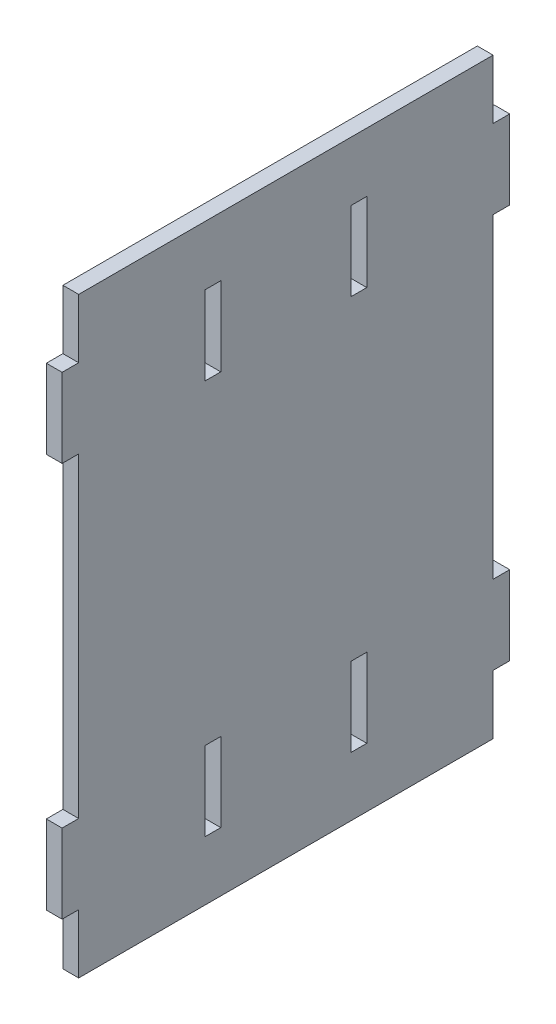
ISO-10303-21;
HEADER;
FILE_DESCRIPTION(('STEP AP214'),'2;1');
FILE_NAME('part.step','',(''),(''),'','','');
FILE_SCHEMA(('AUTOMOTIVE_DESIGN { 1 0 10303 214 1 1 1 1 }'));
ENDSEC;
DATA;
#1=APPLICATION_CONTEXT('core data for automotive mechanical design processes');
#2=APPLICATION_PROTOCOL_DEFINITION('international standard','automotive_design',2000,#1);
#3=PRODUCT_CONTEXT('',#1,'mechanical');
#4=PRODUCT('Part','Part','',(#3));
#5=PRODUCT_RELATED_PRODUCT_CATEGORY('part','',(#4));
#6=PRODUCT_DEFINITION_FORMATION('','',#4);
#7=PRODUCT_DEFINITION_CONTEXT('part definition',#1,'design');
#8=PRODUCT_DEFINITION('design','',#6,#7);
#9=PRODUCT_DEFINITION_SHAPE('','',#8);
#10=(LENGTH_UNIT() NAMED_UNIT(*) SI_UNIT(.MILLI.,.METRE.));
#11=(NAMED_UNIT(*) PLANE_ANGLE_UNIT() SI_UNIT($,.RADIAN.));
#12=(NAMED_UNIT(*) SI_UNIT($,.STERADIAN.) SOLID_ANGLE_UNIT());
#13=UNCERTAINTY_MEASURE_WITH_UNIT(LENGTH_MEASURE(1.E-05),#10,'distance_accuracy_value','');
#14=(GEOMETRIC_REPRESENTATION_CONTEXT(3) GLOBAL_UNCERTAINTY_ASSIGNED_CONTEXT((#13)) GLOBAL_UNIT_ASSIGNED_CONTEXT((#10,
#11,#12)) REPRESENTATION_CONTEXT('',''));
#15=CARTESIAN_POINT('',(0.,0.,0.));
#16=DIRECTION('',(0.,0.,1.));
#17=DIRECTION('',(1.,0.,0.));
#18=AXIS2_PLACEMENT_3D('',#15,#16,#17);
#19=CARTESIAN_POINT('',(4.,15.,52.5));
#20=DIRECTION('',(-1.,0.,0.));
#21=DIRECTION('',(0.,0.,1.));
#22=AXIS2_PLACEMENT_3D('',#19,#20,#21);
#23=PLANE('',#22);
#24=DIRECTION('',(0.,-1.,0.));
#25=VECTOR('',#24,1.);
#26=CARTESIAN_POINT('',(4.,35.,20.5));
#27=LINE('',#26,#25);
#28=CARTESIAN_POINT('',(4.,35.,20.5));
#29=VERTEX_POINT('',#28);
#30=CARTESIAN_POINT('',(4.,15.,20.5));
#31=VERTEX_POINT('',#30);
#32=EDGE_CURVE('E326',#29,#31,#27,.T.);
#33=ORIENTED_EDGE('',*,*,#32,.F.);
#34=DIRECTION('',(0.,0.,1.));
#35=VECTOR('',#34,1.);
#36=CARTESIAN_POINT('',(4.,35.,20.5));
#37=LINE('',#36,#35);
#38=CARTESIAN_POINT('',(4.,35.,16.5));
#39=VERTEX_POINT('',#38);
#40=EDGE_CURVE('E334',#39,#29,#37,.T.);
#41=ORIENTED_EDGE('',*,*,#40,.F.);
#42=DIRECTION('',(0.,1.,0.));
#43=VECTOR('',#42,1.);
#44=CARTESIAN_POINT('',(4.,35.,16.5));
#45=LINE('',#44,#43);
#46=CARTESIAN_POINT('',(4.,15.,16.5));
#47=VERTEX_POINT('',#46);
#48=EDGE_CURVE('E331',#47,#39,#45,.T.);
#49=ORIENTED_EDGE('',*,*,#48,.F.);
#50=DIRECTION('',(0.,0.,-1.));
#51=VECTOR('',#50,1.);
#52=CARTESIAN_POINT('',(4.,15.,20.5));
#53=LINE('',#52,#51);
#54=EDGE_CURVE('E328',#31,#47,#53,.T.);
#55=ORIENTED_EDGE('',*,*,#54,.F.);
#56=EDGE_LOOP('',(#33,#41,#49,#55));
#57=FACE_BOUND('',#56,.T.);
#58=DIRECTION('',(0.,-1.,0.));
#59=VECTOR('',#58,1.);
#60=CARTESIAN_POINT('',(4.,135.,20.5));
#61=LINE('',#60,#59);
#62=CARTESIAN_POINT('',(4.,135.,20.5));
#63=VERTEX_POINT('',#62);
#64=CARTESIAN_POINT('',(4.,115.,20.5));
#65=VERTEX_POINT('',#64);
#66=EDGE_CURVE('E388',#63,#65,#61,.T.);
#67=ORIENTED_EDGE('',*,*,#66,.F.);
#68=DIRECTION('',(0.,0.,1.));
#69=VECTOR('',#68,1.);
#70=CARTESIAN_POINT('',(4.,135.,20.5));
#71=LINE('',#70,#69);
#72=CARTESIAN_POINT('',(4.,135.,16.5));
#73=VERTEX_POINT('',#72);
#74=EDGE_CURVE('E399',#73,#63,#71,.T.);
#75=ORIENTED_EDGE('',*,*,#74,.F.);
#76=DIRECTION('',(0.,1.,0.));
#77=VECTOR('',#76,1.);
#78=CARTESIAN_POINT('',(4.,135.,16.5));
#79=LINE('',#78,#77);
#80=CARTESIAN_POINT('',(4.,115.,16.5));
#81=VERTEX_POINT('',#80);
#82=EDGE_CURVE('E395',#81,#73,#79,.T.);
#83=ORIENTED_EDGE('',*,*,#82,.F.);
#84=DIRECTION('',(0.,0.,-1.));
#85=VECTOR('',#84,1.);
#86=CARTESIAN_POINT('',(4.,115.,20.5));
#87=LINE('',#86,#85);
#88=EDGE_CURVE('E391',#65,#81,#87,.T.);
#89=ORIENTED_EDGE('',*,*,#88,.F.);
#90=EDGE_LOOP('',(#67,#75,#83,#89));
#91=FACE_BOUND('',#90,.T.);
#92=DIRECTION('',(0.,-1.,0.));
#93=VECTOR('',#92,1.);
#94=CARTESIAN_POINT('',(4.,0.,52.5));
#95=LINE('',#94,#93);
#96=CARTESIAN_POINT('',(4.,15.,52.5));
#97=VERTEX_POINT('',#96);
#98=CARTESIAN_POINT('',(4.,0.,52.5));
#99=VERTEX_POINT('',#98);
#100=EDGE_CURVE('E431',#97,#99,#95,.T.);
#101=ORIENTED_EDGE('',*,*,#100,.T.);
#102=DIRECTION('',(0.,0.,-1.));
#103=VECTOR('',#102,1.);
#104=CARTESIAN_POINT('',(4.,0.,52.5));
#105=LINE('',#104,#103);
#106=CARTESIAN_POINT('',(4.,0.,-52.5));
#107=VERTEX_POINT('',#106);
#108=EDGE_CURVE('E434',#99,#107,#105,.T.);
#109=ORIENTED_EDGE('',*,*,#108,.T.);
#110=DIRECTION('',(0.,1.,0.));
#111=VECTOR('',#110,1.);
#112=CARTESIAN_POINT('',(4.,0.,-52.5));
#113=LINE('',#112,#111);
#114=CARTESIAN_POINT('',(4.,15.,-52.5));
#115=VERTEX_POINT('',#114);
#116=EDGE_CURVE('E437',#107,#115,#113,.T.);
#117=ORIENTED_EDGE('',*,*,#116,.T.);
#118=DIRECTION('',(0.,0.,-1.));
#119=VECTOR('',#118,1.);
#120=CARTESIAN_POINT('',(4.,15.,-52.5));
#121=LINE('',#120,#119);
#122=CARTESIAN_POINT('',(4.,15.,-56.7));
#123=VERTEX_POINT('',#122);
#124=EDGE_CURVE('E439',#115,#123,#121,.T.);
#125=ORIENTED_EDGE('',*,*,#124,.T.);
#126=DIRECTION('',(0.,1.,0.));
#127=VECTOR('',#126,1.);
#128=CARTESIAN_POINT('',(4.,35.,-56.7));
#129=LINE('',#128,#127);
#130=CARTESIAN_POINT('',(4.,35.,-56.7));
#131=VERTEX_POINT('',#130);
#132=EDGE_CURVE('E441',#123,#131,#129,.T.);
#133=ORIENTED_EDGE('',*,*,#132,.T.);
#134=DIRECTION('',(0.,0.,1.));
#135=VECTOR('',#134,1.);
#136=CARTESIAN_POINT('',(4.,35.,-52.5));
#137=LINE('',#136,#135);
#138=CARTESIAN_POINT('',(4.,35.,-52.5));
#139=VERTEX_POINT('',#138);
#140=EDGE_CURVE('E443',#131,#139,#137,.T.);
#141=ORIENTED_EDGE('',*,*,#140,.T.);
#142=DIRECTION('',(0.,1.,0.));
#143=VECTOR('',#142,1.);
#144=CARTESIAN_POINT('',(4.,35.,-52.5));
#145=LINE('',#144,#143);
#146=CARTESIAN_POINT('',(4.,115.,-52.5));
#147=VERTEX_POINT('',#146);
#148=EDGE_CURVE('E445',#139,#147,#145,.T.);
#149=ORIENTED_EDGE('',*,*,#148,.T.);
#150=DIRECTION('',(0.,0.,-1.));
#151=VECTOR('',#150,1.);
#152=CARTESIAN_POINT('',(4.,115.,-52.5));
#153=LINE('',#152,#151);
#154=CARTESIAN_POINT('',(4.,115.,-56.7));
#155=VERTEX_POINT('',#154);
#156=EDGE_CURVE('E447',#147,#155,#153,.T.);
#157=ORIENTED_EDGE('',*,*,#156,.T.);
#158=DIRECTION('',(0.,1.,0.));
#159=VECTOR('',#158,1.);
#160=CARTESIAN_POINT('',(4.,135.,-56.7));
#161=LINE('',#160,#159);
#162=CARTESIAN_POINT('',(4.,135.,-56.7));
#163=VERTEX_POINT('',#162);
#164=EDGE_CURVE('E449',#155,#163,#161,.T.);
#165=ORIENTED_EDGE('',*,*,#164,.T.);
#166=DIRECTION('',(0.,0.,1.));
#167=VECTOR('',#166,1.);
#168=CARTESIAN_POINT('',(4.,135.,-52.5));
#169=LINE('',#168,#167);
#170=CARTESIAN_POINT('',(4.,135.,-52.5));
#171=VERTEX_POINT('',#170);
#172=EDGE_CURVE('E451',#163,#171,#169,.T.);
#173=ORIENTED_EDGE('',*,*,#172,.T.);
#174=DIRECTION('',(0.,1.,0.));
#175=VECTOR('',#174,1.);
#176=CARTESIAN_POINT('',(4.,135.,-52.5));
#177=LINE('',#176,#175);
#178=CARTESIAN_POINT('',(4.,150.,-52.5));
#179=VERTEX_POINT('',#178);
#180=EDGE_CURVE('E453',#171,#179,#177,.T.);
#181=ORIENTED_EDGE('',*,*,#180,.T.);
#182=DIRECTION('',(0.,0.,1.));
#183=VECTOR('',#182,1.);
#184=CARTESIAN_POINT('',(4.,150.,52.5));
#185=LINE('',#184,#183);
#186=CARTESIAN_POINT('',(4.,150.,52.5));
#187=VERTEX_POINT('',#186);
#188=EDGE_CURVE('E455',#179,#187,#185,.T.);
#189=ORIENTED_EDGE('',*,*,#188,.T.);
#190=DIRECTION('',(0.,-1.,0.));
#191=VECTOR('',#190,1.);
#192=CARTESIAN_POINT('',(4.,135.,52.5));
#193=LINE('',#192,#191);
#194=CARTESIAN_POINT('',(4.,135.,52.5));
#195=VERTEX_POINT('',#194);
#196=EDGE_CURVE('E458',#187,#195,#193,.T.);
#197=ORIENTED_EDGE('',*,*,#196,.T.);
#198=DIRECTION('',(0.,0.,1.));
#199=VECTOR('',#198,1.);
#200=CARTESIAN_POINT('',(4.,135.,56.7));
#201=LINE('',#200,#199);
#202=CARTESIAN_POINT('',(4.,135.,56.7));
#203=VERTEX_POINT('',#202);
#204=EDGE_CURVE('E461',#195,#203,#201,.T.);
#205=ORIENTED_EDGE('',*,*,#204,.T.);
#206=DIRECTION('',(0.,-1.,0.));
#207=VECTOR('',#206,1.);
#208=CARTESIAN_POINT('',(4.,135.,56.7));
#209=LINE('',#208,#207);
#210=CARTESIAN_POINT('',(4.,115.,56.7));
#211=VERTEX_POINT('',#210);
#212=EDGE_CURVE('E464',#203,#211,#209,.T.);
#213=ORIENTED_EDGE('',*,*,#212,.T.);
#214=DIRECTION('',(0.,0.,-1.));
#215=VECTOR('',#214,1.);
#216=CARTESIAN_POINT('',(4.,115.,56.7));
#217=LINE('',#216,#215);
#218=CARTESIAN_POINT('',(4.,115.,52.5));
#219=VERTEX_POINT('',#218);
#220=EDGE_CURVE('E467',#211,#219,#217,.T.);
#221=ORIENTED_EDGE('',*,*,#220,.T.);
#222=DIRECTION('',(0.,-1.,0.));
#223=VECTOR('',#222,1.);
#224=CARTESIAN_POINT('',(4.,35.,52.5));
#225=LINE('',#224,#223);
#226=CARTESIAN_POINT('',(4.,35.,52.5));
#227=VERTEX_POINT('',#226);
#228=EDGE_CURVE('E470',#219,#227,#225,.T.);
#229=ORIENTED_EDGE('',*,*,#228,.T.);
#230=DIRECTION('',(0.,0.,1.));
#231=VECTOR('',#230,1.);
#232=CARTESIAN_POINT('',(4.,35.,56.7));
#233=LINE('',#232,#231);
#234=CARTESIAN_POINT('',(4.,35.,56.7));
#235=VERTEX_POINT('',#234);
#236=EDGE_CURVE('E473',#227,#235,#233,.T.);
#237=ORIENTED_EDGE('',*,*,#236,.T.);
#238=DIRECTION('',(0.,-1.,0.));
#239=VECTOR('',#238,1.);
#240=CARTESIAN_POINT('',(4.,35.,56.7));
#241=LINE('',#240,#239);
#242=CARTESIAN_POINT('',(4.,15.,56.7));
#243=VERTEX_POINT('',#242);
#244=EDGE_CURVE('E475',#235,#243,#241,.T.);
#245=ORIENTED_EDGE('',*,*,#244,.T.);
#246=DIRECTION('',(0.,0.,-1.));
#247=VECTOR('',#246,1.);
#248=CARTESIAN_POINT('',(4.,15.,56.7));
#249=LINE('',#248,#247);
#250=EDGE_CURVE('E477',#243,#97,#249,.T.);
#251=ORIENTED_EDGE('',*,*,#250,.T.);
#252=EDGE_LOOP('',(#101,#109,#117,#125,#133,#141,#149,#157,#165,#173,#181,#189,#197,#205,#213,
#221,#229,#237,#245,#251));
#253=FACE_BOUND('',#252,.T.);
#254=DIRECTION('',(0.,1.,0.));
#255=VECTOR('',#254,1.);
#256=CARTESIAN_POINT('',(4.,135.,-20.5));
#257=LINE('',#256,#255);
#258=CARTESIAN_POINT('',(4.,115.,-20.5));
#259=VERTEX_POINT('',#258);
#260=CARTESIAN_POINT('',(4.,135.,-20.5));
#261=VERTEX_POINT('',#260);
#262=EDGE_CURVE('E357',#259,#261,#257,.T.);
#263=ORIENTED_EDGE('',*,*,#262,.F.);
#264=DIRECTION('',(0.,0.,-1.));
#265=VECTOR('',#264,1.);
#266=CARTESIAN_POINT('',(4.,115.,-20.5));
#267=LINE('',#266,#265);
#268=CARTESIAN_POINT('',(4.,115.,-16.5));
#269=VERTEX_POINT('',#268);
#270=EDGE_CURVE('E365',#269,#259,#267,.T.);
#271=ORIENTED_EDGE('',*,*,#270,.F.);
#272=DIRECTION('',(0.,-1.,0.));
#273=VECTOR('',#272,1.);
#274=CARTESIAN_POINT('',(4.,135.,-16.5));
#275=LINE('',#274,#273);
#276=CARTESIAN_POINT('',(4.,135.,-16.5));
#277=VERTEX_POINT('',#276);
#278=EDGE_CURVE('E362',#277,#269,#275,.T.);
#279=ORIENTED_EDGE('',*,*,#278,.F.);
#280=DIRECTION('',(0.,0.,1.));
#281=VECTOR('',#280,1.);
#282=CARTESIAN_POINT('',(4.,135.,-20.5));
#283=LINE('',#282,#281);
#284=EDGE_CURVE('E359',#261,#277,#283,.T.);
#285=ORIENTED_EDGE('',*,*,#284,.F.);
#286=EDGE_LOOP('',(#263,#271,#279,#285));
#287=FACE_BOUND('',#286,.T.);
#288=DIRECTION('',(0.,-1.,0.));
#289=VECTOR('',#288,1.);
#290=CARTESIAN_POINT('',(4.,35.,-16.5));
#291=LINE('',#290,#289);
#292=CARTESIAN_POINT('',(4.,35.,-16.5));
#293=VERTEX_POINT('',#292);
#294=CARTESIAN_POINT('',(4.,15.,-16.5));
#295=VERTEX_POINT('',#294);
#296=EDGE_CURVE('E290',#293,#295,#291,.T.);
#297=ORIENTED_EDGE('',*,*,#296,.F.);
#298=DIRECTION('',(0.,0.,1.));
#299=VECTOR('',#298,1.);
#300=CARTESIAN_POINT('',(4.,35.,-16.5));
#301=LINE('',#300,#299);
#302=CARTESIAN_POINT('',(4.,35.,-20.5));
#303=VERTEX_POINT('',#302);
#304=EDGE_CURVE('E312',#303,#293,#301,.T.);
#305=ORIENTED_EDGE('',*,*,#304,.F.);
#306=DIRECTION('',(0.,1.,0.));
#307=VECTOR('',#306,1.);
#308=CARTESIAN_POINT('',(4.,35.,-20.5));
#309=LINE('',#308,#307);
#310=CARTESIAN_POINT('',(4.,15.,-20.5));
#311=VERTEX_POINT('',#310);
#312=EDGE_CURVE('E310',#311,#303,#309,.T.);
#313=ORIENTED_EDGE('',*,*,#312,.F.);
#314=DIRECTION('',(0.,0.,-1.));
#315=VECTOR('',#314,1.);
#316=CARTESIAN_POINT('',(4.,15.,-16.5));
#317=LINE('',#316,#315);
#318=EDGE_CURVE('E298',#295,#311,#317,.T.);
#319=ORIENTED_EDGE('',*,*,#318,.F.);
#320=EDGE_LOOP('',(#297,#305,#313,#319));
#321=FACE_BOUND('',#320,.T.);
#322=ADVANCED_FACE('F39',(#57,#91,#253,#287,#321),#23,.F.);
#323=CARTESIAN_POINT('',(0.,15.,52.5));
#324=DIRECTION('',(-1.,0.,0.));
#325=DIRECTION('',(0.,0.,1.));
#326=AXIS2_PLACEMENT_3D('',#323,#324,#325);
#327=PLANE('',#326);
#328=DIRECTION('',(0.,0.,1.));
#329=VECTOR('',#328,1.);
#330=CARTESIAN_POINT('',(0.,35.,20.5));
#331=LINE('',#330,#329);
#332=CARTESIAN_POINT('',(0.,35.,16.5));
#333=VERTEX_POINT('',#332);
#334=CARTESIAN_POINT('',(0.,35.,20.5));
#335=VERTEX_POINT('',#334);
#336=EDGE_CURVE('E329',#333,#335,#331,.T.);
#337=ORIENTED_EDGE('',*,*,#336,.T.);
#338=DIRECTION('',(0.,-1.,0.));
#339=VECTOR('',#338,1.);
#340=CARTESIAN_POINT('',(0.,35.,20.5));
#341=LINE('',#340,#339);
#342=CARTESIAN_POINT('',(0.,15.,20.5));
#343=VERTEX_POINT('',#342);
#344=EDGE_CURVE('E306',#335,#343,#341,.T.);
#345=ORIENTED_EDGE('',*,*,#344,.T.);
#346=DIRECTION('',(0.,0.,-1.));
#347=VECTOR('',#346,1.);
#348=CARTESIAN_POINT('',(0.,15.,20.5));
#349=LINE('',#348,#347);
#350=CARTESIAN_POINT('',(0.,15.,16.5));
#351=VERTEX_POINT('',#350);
#352=EDGE_CURVE('E339',#343,#351,#349,.T.);
#353=ORIENTED_EDGE('',*,*,#352,.T.);
#354=DIRECTION('',(0.,1.,0.));
#355=VECTOR('',#354,1.);
#356=CARTESIAN_POINT('',(0.,35.,16.5));
#357=LINE('',#356,#355);
#358=EDGE_CURVE('E342',#351,#333,#357,.T.);
#359=ORIENTED_EDGE('',*,*,#358,.T.);
#360=EDGE_LOOP('',(#337,#345,#353,#359));
#361=FACE_BOUND('',#360,.T.);
#362=DIRECTION('',(0.,0.,1.));
#363=VECTOR('',#362,1.);
#364=CARTESIAN_POINT('',(0.,135.,20.5));
#365=LINE('',#364,#363);
#366=CARTESIAN_POINT('',(0.,135.,16.5));
#367=VERTEX_POINT('',#366);
#368=CARTESIAN_POINT('',(0.,135.,20.5));
#369=VERTEX_POINT('',#368);
#370=EDGE_CURVE('E392',#367,#369,#365,.T.);
#371=ORIENTED_EDGE('',*,*,#370,.T.);
#372=DIRECTION('',(0.,-1.,0.));
#373=VECTOR('',#372,1.);
#374=CARTESIAN_POINT('',(0.,135.,20.5));
#375=LINE('',#374,#373);
#376=CARTESIAN_POINT('',(0.,115.,20.5));
#377=VERTEX_POINT('',#376);
#378=EDGE_CURVE('E387',#369,#377,#375,.T.);
#379=ORIENTED_EDGE('',*,*,#378,.T.);
#380=DIRECTION('',(0.,0.,-1.));
#381=VECTOR('',#380,1.);
#382=CARTESIAN_POINT('',(0.,115.,20.5));
#383=LINE('',#382,#381);
#384=CARTESIAN_POINT('',(0.,115.,16.5));
#385=VERTEX_POINT('',#384);
#386=EDGE_CURVE('E406',#377,#385,#383,.T.);
#387=ORIENTED_EDGE('',*,*,#386,.T.);
#388=DIRECTION('',(0.,1.,0.));
#389=VECTOR('',#388,1.);
#390=CARTESIAN_POINT('',(0.,135.,16.5));
#391=LINE('',#390,#389);
#392=EDGE_CURVE('E410',#385,#367,#391,.T.);
#393=ORIENTED_EDGE('',*,*,#392,.T.);
#394=EDGE_LOOP('',(#371,#379,#387,#393));
#395=FACE_BOUND('',#394,.T.);
#396=DIRECTION('',(0.,-1.,0.));
#397=VECTOR('',#396,1.);
#398=CARTESIAN_POINT('',(0.,0.,52.5));
#399=LINE('',#398,#397);
#400=CARTESIAN_POINT('',(0.,15.,52.5));
#401=VERTEX_POINT('',#400);
#402=CARTESIAN_POINT('',(0.,0.,52.5));
#403=VERTEX_POINT('',#402);
#404=EDGE_CURVE('E430',#401,#403,#399,.T.);
#405=ORIENTED_EDGE('',*,*,#404,.F.);
#406=DIRECTION('',(0.,0.,-1.));
#407=VECTOR('',#406,1.);
#408=CARTESIAN_POINT('',(0.,15.,56.7));
#409=LINE('',#408,#407);
#410=CARTESIAN_POINT('',(0.,15.,56.7));
#411=VERTEX_POINT('',#410);
#412=EDGE_CURVE('E435',#411,#401,#409,.T.);
#413=ORIENTED_EDGE('',*,*,#412,.F.);
#414=DIRECTION('',(0.,-1.,0.));
#415=VECTOR('',#414,1.);
#416=CARTESIAN_POINT('',(0.,35.,56.7));
#417=LINE('',#416,#415);
#418=CARTESIAN_POINT('',(0.,35.,56.7));
#419=VERTEX_POINT('',#418);
#420=EDGE_CURVE('E522',#419,#411,#417,.T.);
#421=ORIENTED_EDGE('',*,*,#420,.F.);
#422=DIRECTION('',(0.,0.,1.));
#423=VECTOR('',#422,1.);
#424=CARTESIAN_POINT('',(0.,35.,56.7));
#425=LINE('',#424,#423);
#426=CARTESIAN_POINT('',(0.,35.,52.5));
#427=VERTEX_POINT('',#426);
#428=EDGE_CURVE('E520',#427,#419,#425,.T.);
#429=ORIENTED_EDGE('',*,*,#428,.F.);
#430=DIRECTION('',(0.,-1.,0.));
#431=VECTOR('',#430,1.);
#432=CARTESIAN_POINT('',(0.,35.,52.5));
#433=LINE('',#432,#431);
#434=CARTESIAN_POINT('',(0.,115.,52.5));
#435=VERTEX_POINT('',#434);
#436=EDGE_CURVE('E517',#435,#427,#433,.T.);
#437=ORIENTED_EDGE('',*,*,#436,.F.);
#438=DIRECTION('',(0.,0.,-1.));
#439=VECTOR('',#438,1.);
#440=CARTESIAN_POINT('',(0.,115.,56.7));
#441=LINE('',#440,#439);
#442=CARTESIAN_POINT('',(0.,115.,56.7));
#443=VERTEX_POINT('',#442);
#444=EDGE_CURVE('E514',#443,#435,#441,.T.);
#445=ORIENTED_EDGE('',*,*,#444,.F.);
#446=DIRECTION('',(0.,-1.,0.));
#447=VECTOR('',#446,1.);
#448=CARTESIAN_POINT('',(0.,135.,56.7));
#449=LINE('',#448,#447);
#450=CARTESIAN_POINT('',(0.,135.,56.7));
#451=VERTEX_POINT('',#450);
#452=EDGE_CURVE('E511',#451,#443,#449,.T.);
#453=ORIENTED_EDGE('',*,*,#452,.F.);
#454=DIRECTION('',(0.,0.,1.));
#455=VECTOR('',#454,1.);
#456=CARTESIAN_POINT('',(0.,135.,56.7));
#457=LINE('',#456,#455);
#458=CARTESIAN_POINT('',(0.,135.,52.5));
#459=VERTEX_POINT('',#458);
#460=EDGE_CURVE('E508',#459,#451,#457,.T.);
#461=ORIENTED_EDGE('',*,*,#460,.F.);
#462=DIRECTION('',(0.,-1.,0.));
#463=VECTOR('',#462,1.);
#464=CARTESIAN_POINT('',(0.,135.,52.5));
#465=LINE('',#464,#463);
#466=CARTESIAN_POINT('',(0.,150.,52.5));
#467=VERTEX_POINT('',#466);
#468=EDGE_CURVE('E505',#467,#459,#465,.T.);
#469=ORIENTED_EDGE('',*,*,#468,.F.);
#470=DIRECTION('',(0.,0.,1.));
#471=VECTOR('',#470,1.);
#472=CARTESIAN_POINT('',(0.,150.,52.5));
#473=LINE('',#472,#471);
#474=CARTESIAN_POINT('',(0.,150.,-52.5));
#475=VERTEX_POINT('',#474);
#476=EDGE_CURVE('E502',#475,#467,#473,.T.);
#477=ORIENTED_EDGE('',*,*,#476,.F.);
#478=DIRECTION('',(0.,1.,0.));
#479=VECTOR('',#478,1.);
#480=CARTESIAN_POINT('',(0.,135.,-52.5));
#481=LINE('',#480,#479);
#482=CARTESIAN_POINT('',(0.,135.,-52.5));
#483=VERTEX_POINT('',#482);
#484=EDGE_CURVE('E500',#483,#475,#481,.T.);
#485=ORIENTED_EDGE('',*,*,#484,.F.);
#486=DIRECTION('',(0.,0.,1.));
#487=VECTOR('',#486,1.);
#488=CARTESIAN_POINT('',(0.,135.,-52.5));
#489=LINE('',#488,#487);
#490=CARTESIAN_POINT('',(0.,135.,-56.7));
#491=VERTEX_POINT('',#490);
#492=EDGE_CURVE('E498',#491,#483,#489,.T.);
#493=ORIENTED_EDGE('',*,*,#492,.F.);
#494=DIRECTION('',(0.,1.,0.));
#495=VECTOR('',#494,1.);
#496=CARTESIAN_POINT('',(0.,135.,-56.7));
#497=LINE('',#496,#495);
#498=CARTESIAN_POINT('',(0.,115.,-56.7));
#499=VERTEX_POINT('',#498);
#500=EDGE_CURVE('E496',#499,#491,#497,.T.);
#501=ORIENTED_EDGE('',*,*,#500,.F.);
#502=DIRECTION('',(0.,0.,-1.));
#503=VECTOR('',#502,1.);
#504=CARTESIAN_POINT('',(0.,115.,-52.5));
#505=LINE('',#504,#503);
#506=CARTESIAN_POINT('',(0.,115.,-52.5));
#507=VERTEX_POINT('',#506);
#508=EDGE_CURVE('E494',#507,#499,#505,.T.);
#509=ORIENTED_EDGE('',*,*,#508,.F.);
#510=DIRECTION('',(0.,1.,0.));
#511=VECTOR('',#510,1.);
#512=CARTESIAN_POINT('',(0.,35.,-52.5));
#513=LINE('',#512,#511);
#514=CARTESIAN_POINT('',(0.,35.,-52.5));
#515=VERTEX_POINT('',#514);
#516=EDGE_CURVE('E492',#515,#507,#513,.T.);
#517=ORIENTED_EDGE('',*,*,#516,.F.);
#518=DIRECTION('',(0.,0.,1.));
#519=VECTOR('',#518,1.);
#520=CARTESIAN_POINT('',(0.,35.,-52.5));
#521=LINE('',#520,#519);
#522=CARTESIAN_POINT('',(0.,35.,-56.7));
#523=VERTEX_POINT('',#522);
#524=EDGE_CURVE('E490',#523,#515,#521,.T.);
#525=ORIENTED_EDGE('',*,*,#524,.F.);
#526=DIRECTION('',(0.,1.,0.));
#527=VECTOR('',#526,1.);
#528=CARTESIAN_POINT('',(0.,35.,-56.7));
#529=LINE('',#528,#527);
#530=CARTESIAN_POINT('',(0.,15.,-56.7));
#531=VERTEX_POINT('',#530);
#532=EDGE_CURVE('E488',#531,#523,#529,.T.);
#533=ORIENTED_EDGE('',*,*,#532,.F.);
#534=DIRECTION('',(0.,0.,-1.));
#535=VECTOR('',#534,1.);
#536=CARTESIAN_POINT('',(0.,15.,-52.5));
#537=LINE('',#536,#535);
#538=CARTESIAN_POINT('',(0.,15.,-52.5));
#539=VERTEX_POINT('',#538);
#540=EDGE_CURVE('E486',#539,#531,#537,.T.);
#541=ORIENTED_EDGE('',*,*,#540,.F.);
#542=DIRECTION('',(0.,1.,0.));
#543=VECTOR('',#542,1.);
#544=CARTESIAN_POINT('',(0.,0.,-52.5));
#545=LINE('',#544,#543);
#546=CARTESIAN_POINT('',(0.,0.,-52.5));
#547=VERTEX_POINT('',#546);
#548=EDGE_CURVE('E484',#547,#539,#545,.T.);
#549=ORIENTED_EDGE('',*,*,#548,.F.);
#550=DIRECTION('',(0.,0.,-1.));
#551=VECTOR('',#550,1.);
#552=CARTESIAN_POINT('',(0.,0.,52.5));
#553=LINE('',#552,#551);
#554=EDGE_CURVE('E482',#403,#547,#553,.T.);
#555=ORIENTED_EDGE('',*,*,#554,.F.);
#556=EDGE_LOOP('',(#405,#413,#421,#429,#437,#445,#453,#461,#469,#477,#485,#493,#501,#509,#517,
#525,#533,#541,#549,#555));
#557=FACE_BOUND('',#556,.T.);
#558=DIRECTION('',(0.,0.,-1.));
#559=VECTOR('',#558,1.);
#560=CARTESIAN_POINT('',(0.,115.,-20.5));
#561=LINE('',#560,#559);
#562=CARTESIAN_POINT('',(0.,115.,-16.5));
#563=VERTEX_POINT('',#562);
#564=CARTESIAN_POINT('',(0.,115.,-20.5));
#565=VERTEX_POINT('',#564);
#566=EDGE_CURVE('E360',#563,#565,#561,.T.);
#567=ORIENTED_EDGE('',*,*,#566,.T.);
#568=DIRECTION('',(0.,1.,0.));
#569=VECTOR('',#568,1.);
#570=CARTESIAN_POINT('',(0.,135.,-20.5));
#571=LINE('',#570,#569);
#572=CARTESIAN_POINT('',(0.,135.,-20.5));
#573=VERTEX_POINT('',#572);
#574=EDGE_CURVE('E356',#565,#573,#571,.T.);
#575=ORIENTED_EDGE('',*,*,#574,.T.);
#576=DIRECTION('',(0.,0.,1.));
#577=VECTOR('',#576,1.);
#578=CARTESIAN_POINT('',(0.,135.,-20.5));
#579=LINE('',#578,#577);
#580=CARTESIAN_POINT('',(0.,135.,-16.5));
#581=VERTEX_POINT('',#580);
#582=EDGE_CURVE('E370',#573,#581,#579,.T.);
#583=ORIENTED_EDGE('',*,*,#582,.T.);
#584=DIRECTION('',(0.,-1.,0.));
#585=VECTOR('',#584,1.);
#586=CARTESIAN_POINT('',(0.,135.,-16.5));
#587=LINE('',#586,#585);
#588=EDGE_CURVE('E373',#581,#563,#587,.T.);
#589=ORIENTED_EDGE('',*,*,#588,.T.);
#590=EDGE_LOOP('',(#567,#575,#583,#589));
#591=FACE_BOUND('',#590,.T.);
#592=DIRECTION('',(0.,0.,1.));
#593=VECTOR('',#592,1.);
#594=CARTESIAN_POINT('',(0.,35.,-16.5));
#595=LINE('',#594,#593);
#596=CARTESIAN_POINT('',(0.,35.,-20.5));
#597=VERTEX_POINT('',#596);
#598=CARTESIAN_POINT('',(0.,35.,-16.5));
#599=VERTEX_POINT('',#598);
#600=EDGE_CURVE('E299',#597,#599,#595,.T.);
#601=ORIENTED_EDGE('',*,*,#600,.T.);
#602=DIRECTION('',(0.,-1.,0.));
#603=VECTOR('',#602,1.);
#604=CARTESIAN_POINT('',(0.,35.,-16.5));
#605=LINE('',#604,#603);
#606=CARTESIAN_POINT('',(0.,15.,-16.5));
#607=VERTEX_POINT('',#606);
#608=EDGE_CURVE('E62',#599,#607,#605,.T.);
#609=ORIENTED_EDGE('',*,*,#608,.T.);
#610=DIRECTION('',(0.,0.,-1.));
#611=VECTOR('',#610,1.);
#612=CARTESIAN_POINT('',(0.,15.,-16.5));
#613=LINE('',#612,#611);
#614=CARTESIAN_POINT('',(0.,15.,-20.5));
#615=VERTEX_POINT('',#614);
#616=EDGE_CURVE('E305',#607,#615,#613,.T.);
#617=ORIENTED_EDGE('',*,*,#616,.T.);
#618=DIRECTION('',(0.,1.,0.));
#619=VECTOR('',#618,1.);
#620=CARTESIAN_POINT('',(0.,35.,-20.5));
#621=LINE('',#620,#619);
#622=EDGE_CURVE('E318',#615,#597,#621,.T.);
#623=ORIENTED_EDGE('',*,*,#622,.T.);
#624=EDGE_LOOP('',(#601,#609,#617,#623));
#625=FACE_BOUND('',#624,.T.);
#626=ADVANCED_FACE('F593',(#361,#395,#557,#591,#625),#327,.T.);
#627=CARTESIAN_POINT('',(4.,0.,52.5));
#628=DIRECTION('',(0.,0.,-1.));
#629=DIRECTION('',(-1.,0.,0.));
#630=AXIS2_PLACEMENT_3D('',#627,#628,#629);
#631=PLANE('',#630);
#632=ORIENTED_EDGE('',*,*,#404,.T.);
#633=DIRECTION('',(-1.,0.,0.));
#634=VECTOR('',#633,1.);
#635=CARTESIAN_POINT('',(4.,0.,52.5));
#636=LINE('',#635,#634);
#637=EDGE_CURVE('E11',#99,#403,#636,.T.);
#638=ORIENTED_EDGE('',*,*,#637,.F.);
#639=ORIENTED_EDGE('',*,*,#100,.F.);
#640=DIRECTION('',(-1.,0.,0.));
#641=VECTOR('',#640,1.);
#642=CARTESIAN_POINT('',(4.,15.,52.5));
#643=LINE('',#642,#641);
#644=EDGE_CURVE('E479',#97,#401,#643,.T.);
#645=ORIENTED_EDGE('',*,*,#644,.T.);
#646=EDGE_LOOP('',(#632,#638,#639,#645));
#647=FACE_BOUND('',#646,.T.);
#648=ADVANCED_FACE('F41',(#647),#631,.F.);
#649=CARTESIAN_POINT('',(4.,0.,52.5));
#650=DIRECTION('',(0.,1.,0.));
#651=DIRECTION('',(0.,0.,1.));
#652=AXIS2_PLACEMENT_3D('',#649,#650,#651);
#653=PLANE('',#652);
#654=ORIENTED_EDGE('',*,*,#554,.T.);
#655=DIRECTION('',(-1.,0.,0.));
#656=VECTOR('',#655,1.);
#657=CARTESIAN_POINT('',(4.,0.,-52.5));
#658=LINE('',#657,#656);
#659=EDGE_CURVE('E47',#107,#547,#658,.T.);
#660=ORIENTED_EDGE('',*,*,#659,.F.);
#661=ORIENTED_EDGE('',*,*,#108,.F.);
#662=ORIENTED_EDGE('',*,*,#637,.T.);
#663=EDGE_LOOP('',(#654,#660,#661,#662));
#664=FACE_BOUND('',#663,.T.);
#665=ADVANCED_FACE('F611',(#664),#653,.F.);
#666=CARTESIAN_POINT('',(4.,0.,-52.5));
#667=DIRECTION('',(0.,0.,1.));
#668=DIRECTION('',(1.,0.,0.));
#669=AXIS2_PLACEMENT_3D('',#666,#667,#668);
#670=PLANE('',#669);
#671=ORIENTED_EDGE('',*,*,#548,.T.);
#672=DIRECTION('',(-1.,0.,0.));
#673=VECTOR('',#672,1.);
#674=CARTESIAN_POINT('',(4.,15.,-52.5));
#675=LINE('',#674,#673);
#676=EDGE_CURVE('E580',#115,#539,#675,.T.);
#677=ORIENTED_EDGE('',*,*,#676,.F.);
#678=ORIENTED_EDGE('',*,*,#116,.F.);
#679=ORIENTED_EDGE('',*,*,#659,.T.);
#680=EDGE_LOOP('',(#671,#677,#678,#679));
#681=FACE_BOUND('',#680,.T.);
#682=ADVANCED_FACE('F587',(#681),#670,.F.);
#683=CARTESIAN_POINT('',(4.,15.,-52.5));
#684=DIRECTION('',(0.,1.,0.));
#685=DIRECTION('',(0.,0.,1.));
#686=AXIS2_PLACEMENT_3D('',#683,#684,#685);
#687=PLANE('',#686);
#688=ORIENTED_EDGE('',*,*,#540,.T.);
#689=DIRECTION('',(-1.,0.,0.));
#690=VECTOR('',#689,1.);
#691=CARTESIAN_POINT('',(4.,15.,-56.7));
#692=LINE('',#691,#690);
#693=EDGE_CURVE('E577',#123,#531,#692,.T.);
#694=ORIENTED_EDGE('',*,*,#693,.F.);
#695=ORIENTED_EDGE('',*,*,#124,.F.);
#696=ORIENTED_EDGE('',*,*,#676,.T.);
#697=EDGE_LOOP('',(#688,#694,#695,#696));
#698=FACE_BOUND('',#697,.T.);
#699=ADVANCED_FACE('F599',(#698),#687,.F.);
#700=CARTESIAN_POINT('',(4.,35.,-56.7));
#701=DIRECTION('',(0.,0.,1.));
#702=DIRECTION('',(1.,0.,0.));
#703=AXIS2_PLACEMENT_3D('',#700,#701,#702);
#704=PLANE('',#703);
#705=ORIENTED_EDGE('',*,*,#532,.T.);
#706=DIRECTION('',(-1.,0.,0.));
#707=VECTOR('',#706,1.);
#708=CARTESIAN_POINT('',(4.,35.,-56.7));
#709=LINE('',#708,#707);
#710=EDGE_CURVE('E574',#131,#523,#709,.T.);
#711=ORIENTED_EDGE('',*,*,#710,.F.);
#712=ORIENTED_EDGE('',*,*,#132,.F.);
#713=ORIENTED_EDGE('',*,*,#693,.T.);
#714=EDGE_LOOP('',(#705,#711,#712,#713));
#715=FACE_BOUND('',#714,.T.);
#716=ADVANCED_FACE('F603',(#715),#704,.F.);
#717=CARTESIAN_POINT('',(4.,35.,-52.5));
#718=DIRECTION('',(0.,-1.,0.));
#719=DIRECTION('',(0.,0.,-1.));
#720=AXIS2_PLACEMENT_3D('',#717,#718,#719);
#721=PLANE('',#720);
#722=ORIENTED_EDGE('',*,*,#524,.T.);
#723=DIRECTION('',(-1.,0.,0.));
#724=VECTOR('',#723,1.);
#725=CARTESIAN_POINT('',(4.,35.,-52.5));
#726=LINE('',#725,#724);
#727=EDGE_CURVE('E571',#139,#515,#726,.T.);
#728=ORIENTED_EDGE('',*,*,#727,.F.);
#729=ORIENTED_EDGE('',*,*,#140,.F.);
#730=ORIENTED_EDGE('',*,*,#710,.T.);
#731=EDGE_LOOP('',(#722,#728,#729,#730));
#732=FACE_BOUND('',#731,.T.);
#733=ADVANCED_FACE('F684',(#732),#721,.F.);
#734=CARTESIAN_POINT('',(4.,35.,-52.5));
#735=DIRECTION('',(0.,0.,1.));
#736=DIRECTION('',(0.,-1.,0.));
#737=AXIS2_PLACEMENT_3D('',#734,#735,#736);
#738=PLANE('',#737);
#739=ORIENTED_EDGE('',*,*,#516,.T.);
#740=DIRECTION('',(-1.,0.,0.));
#741=VECTOR('',#740,1.);
#742=CARTESIAN_POINT('',(4.,115.,-52.5));
#743=LINE('',#742,#741);
#744=EDGE_CURVE('E568',#147,#507,#743,.T.);
#745=ORIENTED_EDGE('',*,*,#744,.F.);
#746=ORIENTED_EDGE('',*,*,#148,.F.);
#747=ORIENTED_EDGE('',*,*,#727,.T.);
#748=EDGE_LOOP('',(#739,#745,#746,#747));
#749=FACE_BOUND('',#748,.T.);
#750=ADVANCED_FACE('F682',(#749),#738,.F.);
#751=CARTESIAN_POINT('',(4.,115.,-52.5));
#752=DIRECTION('',(0.,1.,0.));
#753=DIRECTION('',(0.,0.,1.));
#754=AXIS2_PLACEMENT_3D('',#751,#752,#753);
#755=PLANE('',#754);
#756=ORIENTED_EDGE('',*,*,#508,.T.);
#757=DIRECTION('',(-1.,0.,0.));
#758=VECTOR('',#757,1.);
#759=CARTESIAN_POINT('',(4.,115.,-56.7));
#760=LINE('',#759,#758);
#761=EDGE_CURVE('E565',#155,#499,#760,.T.);
#762=ORIENTED_EDGE('',*,*,#761,.F.);
#763=ORIENTED_EDGE('',*,*,#156,.F.);
#764=ORIENTED_EDGE('',*,*,#744,.T.);
#765=EDGE_LOOP('',(#756,#762,#763,#764));
#766=FACE_BOUND('',#765,.T.);
#767=ADVANCED_FACE('F677',(#766),#755,.F.);
#768=CARTESIAN_POINT('',(4.,135.,-56.7));
#769=DIRECTION('',(0.,0.,1.));
#770=DIRECTION('',(0.,-1.,0.));
#771=AXIS2_PLACEMENT_3D('',#768,#769,#770);
#772=PLANE('',#771);
#773=ORIENTED_EDGE('',*,*,#500,.T.);
#774=DIRECTION('',(-1.,0.,0.));
#775=VECTOR('',#774,1.);
#776=CARTESIAN_POINT('',(4.,135.,-56.7));
#777=LINE('',#776,#775);
#778=EDGE_CURVE('E562',#163,#491,#777,.T.);
#779=ORIENTED_EDGE('',*,*,#778,.F.);
#780=ORIENTED_EDGE('',*,*,#164,.F.);
#781=ORIENTED_EDGE('',*,*,#761,.T.);
#782=EDGE_LOOP('',(#773,#779,#780,#781));
#783=FACE_BOUND('',#782,.T.);
#784=ADVANCED_FACE('F672',(#783),#772,.F.);
#785=CARTESIAN_POINT('',(4.,135.,-52.5));
#786=DIRECTION('',(0.,-1.,0.));
#787=DIRECTION('',(0.,0.,-1.));
#788=AXIS2_PLACEMENT_3D('',#785,#786,#787);
#789=PLANE('',#788);
#790=ORIENTED_EDGE('',*,*,#492,.T.);
#791=DIRECTION('',(-1.,0.,0.));
#792=VECTOR('',#791,1.);
#793=CARTESIAN_POINT('',(4.,135.,-52.5));
#794=LINE('',#793,#792);
#795=EDGE_CURVE('E559',#171,#483,#794,.T.);
#796=ORIENTED_EDGE('',*,*,#795,.F.);
#797=ORIENTED_EDGE('',*,*,#172,.F.);
#798=ORIENTED_EDGE('',*,*,#778,.T.);
#799=EDGE_LOOP('',(#790,#796,#797,#798));
#800=FACE_BOUND('',#799,.T.);
#801=ADVANCED_FACE('F668',(#800),#789,.F.);
#802=CARTESIAN_POINT('',(4.,135.,-52.5));
#803=DIRECTION('',(0.,0.,1.));
#804=DIRECTION('',(1.,0.,0.));
#805=AXIS2_PLACEMENT_3D('',#802,#803,#804);
#806=PLANE('',#805);
#807=ORIENTED_EDGE('',*,*,#484,.T.);
#808=DIRECTION('',(-1.,0.,0.));
#809=VECTOR('',#808,1.);
#810=CARTESIAN_POINT('',(4.,150.,-52.5));
#811=LINE('',#810,#809);
#812=EDGE_CURVE('E556',#179,#475,#811,.T.);
#813=ORIENTED_EDGE('',*,*,#812,.F.);
#814=ORIENTED_EDGE('',*,*,#180,.F.);
#815=ORIENTED_EDGE('',*,*,#795,.T.);
#816=EDGE_LOOP('',(#807,#813,#814,#815));
#817=FACE_BOUND('',#816,.T.);
#818=ADVANCED_FACE('F663',(#817),#806,.F.);
#819=CARTESIAN_POINT('',(4.,150.,52.5));
#820=DIRECTION('',(0.,-1.,0.));
#821=DIRECTION('',(0.,0.,-1.));
#822=AXIS2_PLACEMENT_3D('',#819,#820,#821);
#823=PLANE('',#822);
#824=ORIENTED_EDGE('',*,*,#476,.T.);
#825=DIRECTION('',(-1.,0.,0.));
#826=VECTOR('',#825,1.);
#827=CARTESIAN_POINT('',(4.,150.,52.5));
#828=LINE('',#827,#826);
#829=EDGE_CURVE('E552',#187,#467,#828,.T.);
#830=ORIENTED_EDGE('',*,*,#829,.F.);
#831=ORIENTED_EDGE('',*,*,#188,.F.);
#832=ORIENTED_EDGE('',*,*,#812,.T.);
#833=EDGE_LOOP('',(#824,#830,#831,#832));
#834=FACE_BOUND('',#833,.T.);
#835=ADVANCED_FACE('F657',(#834),#823,.F.);
#836=CARTESIAN_POINT('',(4.,135.,52.5));
#837=DIRECTION('',(0.,0.,-1.));
#838=DIRECTION('',(-1.,0.,0.));
#839=AXIS2_PLACEMENT_3D('',#836,#837,#838);
#840=PLANE('',#839);
#841=ORIENTED_EDGE('',*,*,#468,.T.);
#842=DIRECTION('',(-1.,0.,0.));
#843=VECTOR('',#842,1.);
#844=CARTESIAN_POINT('',(4.,135.,52.5));
#845=LINE('',#844,#843);
#846=EDGE_CURVE('E548',#195,#459,#845,.T.);
#847=ORIENTED_EDGE('',*,*,#846,.F.);
#848=ORIENTED_EDGE('',*,*,#196,.F.);
#849=ORIENTED_EDGE('',*,*,#829,.T.);
#850=EDGE_LOOP('',(#841,#847,#848,#849));
#851=FACE_BOUND('',#850,.T.);
#852=ADVANCED_FACE('F653',(#851),#840,.F.);
#853=CARTESIAN_POINT('',(4.,135.,56.7));
#854=DIRECTION('',(0.,-1.,0.));
#855=DIRECTION('',(0.,0.,-1.));
#856=AXIS2_PLACEMENT_3D('',#853,#854,#855);
#857=PLANE('',#856);
#858=ORIENTED_EDGE('',*,*,#460,.T.);
#859=DIRECTION('',(-1.,0.,0.));
#860=VECTOR('',#859,1.);
#861=CARTESIAN_POINT('',(4.,135.,56.7));
#862=LINE('',#861,#860);
#863=EDGE_CURVE('E544',#203,#451,#862,.T.);
#864=ORIENTED_EDGE('',*,*,#863,.F.);
#865=ORIENTED_EDGE('',*,*,#204,.F.);
#866=ORIENTED_EDGE('',*,*,#846,.T.);
#867=EDGE_LOOP('',(#858,#864,#865,#866));
#868=FACE_BOUND('',#867,.T.);
#869=ADVANCED_FACE('F648',(#868),#857,.F.);
#870=CARTESIAN_POINT('',(4.,135.,56.7));
#871=DIRECTION('',(0.,0.,-1.));
#872=DIRECTION('',(0.,1.,0.));
#873=AXIS2_PLACEMENT_3D('',#870,#871,#872);
#874=PLANE('',#873);
#875=ORIENTED_EDGE('',*,*,#452,.T.);
#876=DIRECTION('',(-1.,0.,0.));
#877=VECTOR('',#876,1.);
#878=CARTESIAN_POINT('',(4.,115.,56.7));
#879=LINE('',#878,#877);
#880=EDGE_CURVE('E540',#211,#443,#879,.T.);
#881=ORIENTED_EDGE('',*,*,#880,.F.);
#882=ORIENTED_EDGE('',*,*,#212,.F.);
#883=ORIENTED_EDGE('',*,*,#863,.T.);
#884=EDGE_LOOP('',(#875,#881,#882,#883));
#885=FACE_BOUND('',#884,.T.);
#886=ADVANCED_FACE('F642',(#885),#874,.F.);
#887=CARTESIAN_POINT('',(4.,115.,56.7));
#888=DIRECTION('',(0.,1.,0.));
#889=DIRECTION('',(0.,0.,1.));
#890=AXIS2_PLACEMENT_3D('',#887,#888,#889);
#891=PLANE('',#890);
#892=ORIENTED_EDGE('',*,*,#444,.T.);
#893=DIRECTION('',(-1.,0.,0.));
#894=VECTOR('',#893,1.);
#895=CARTESIAN_POINT('',(4.,115.,52.5));
#896=LINE('',#895,#894);
#897=EDGE_CURVE('E536',#219,#435,#896,.T.);
#898=ORIENTED_EDGE('',*,*,#897,.F.);
#899=ORIENTED_EDGE('',*,*,#220,.F.);
#900=ORIENTED_EDGE('',*,*,#880,.T.);
#901=EDGE_LOOP('',(#892,#898,#899,#900));
#902=FACE_BOUND('',#901,.T.);
#903=ADVANCED_FACE('F638',(#902),#891,.F.);
#904=CARTESIAN_POINT('',(4.,35.,52.5));
#905=DIRECTION('',(0.,0.,-1.));
#906=DIRECTION('',(0.,1.,0.));
#907=AXIS2_PLACEMENT_3D('',#904,#905,#906);
#908=PLANE('',#907);
#909=ORIENTED_EDGE('',*,*,#436,.T.);
#910=DIRECTION('',(-1.,0.,0.));
#911=VECTOR('',#910,1.);
#912=CARTESIAN_POINT('',(4.,35.,52.5));
#913=LINE('',#912,#911);
#914=EDGE_CURVE('E533',#227,#427,#913,.T.);
#915=ORIENTED_EDGE('',*,*,#914,.F.);
#916=ORIENTED_EDGE('',*,*,#228,.F.);
#917=ORIENTED_EDGE('',*,*,#897,.T.);
#918=EDGE_LOOP('',(#909,#915,#916,#917));
#919=FACE_BOUND('',#918,.T.);
#920=ADVANCED_FACE('F633',(#919),#908,.F.);
#921=CARTESIAN_POINT('',(4.,35.,56.7));
#922=DIRECTION('',(0.,-1.,0.));
#923=DIRECTION('',(0.,0.,-1.));
#924=AXIS2_PLACEMENT_3D('',#921,#922,#923);
#925=PLANE('',#924);
#926=ORIENTED_EDGE('',*,*,#428,.T.);
#927=DIRECTION('',(-1.,0.,0.));
#928=VECTOR('',#927,1.);
#929=CARTESIAN_POINT('',(4.,35.,56.7));
#930=LINE('',#929,#928);
#931=EDGE_CURVE('E530',#235,#419,#930,.T.);
#932=ORIENTED_EDGE('',*,*,#931,.F.);
#933=ORIENTED_EDGE('',*,*,#236,.F.);
#934=ORIENTED_EDGE('',*,*,#914,.T.);
#935=EDGE_LOOP('',(#926,#932,#933,#934));
#936=FACE_BOUND('',#935,.T.);
#937=ADVANCED_FACE('F627',(#936),#925,.F.);
#938=CARTESIAN_POINT('',(4.,35.,56.7));
#939=DIRECTION('',(0.,0.,-1.));
#940=DIRECTION('',(-1.,0.,0.));
#941=AXIS2_PLACEMENT_3D('',#938,#939,#940);
#942=PLANE('',#941);
#943=ORIENTED_EDGE('',*,*,#420,.T.);
#944=DIRECTION('',(-1.,0.,0.));
#945=VECTOR('',#944,1.);
#946=CARTESIAN_POINT('',(4.,15.,56.7));
#947=LINE('',#946,#945);
#948=EDGE_CURVE('E527',#243,#411,#947,.T.);
#949=ORIENTED_EDGE('',*,*,#948,.F.);
#950=ORIENTED_EDGE('',*,*,#244,.F.);
#951=ORIENTED_EDGE('',*,*,#931,.T.);
#952=EDGE_LOOP('',(#943,#949,#950,#951));
#953=FACE_BOUND('',#952,.T.);
#954=ADVANCED_FACE('F623',(#953),#942,.F.);
#955=CARTESIAN_POINT('',(4.,15.,56.7));
#956=DIRECTION('',(0.,1.,0.));
#957=DIRECTION('',(0.,0.,1.));
#958=AXIS2_PLACEMENT_3D('',#955,#956,#957);
#959=PLANE('',#958);
#960=ORIENTED_EDGE('',*,*,#412,.T.);
#961=ORIENTED_EDGE('',*,*,#644,.F.);
#962=ORIENTED_EDGE('',*,*,#250,.F.);
#963=ORIENTED_EDGE('',*,*,#948,.T.);
#964=EDGE_LOOP('',(#960,#961,#962,#963));
#965=FACE_BOUND('',#964,.T.);
#966=ADVANCED_FACE('F618',(#965),#959,.F.);
#967=CARTESIAN_POINT('',(4.,135.,20.5));
#968=DIRECTION('',(0.,0.,-1.));
#969=DIRECTION('',(0.,1.,0.));
#970=AXIS2_PLACEMENT_3D('',#967,#968,#969);
#971=PLANE('',#970);
#972=ORIENTED_EDGE('',*,*,#378,.F.);
#973=DIRECTION('',(-1.,0.,0.));
#974=VECTOR('',#973,1.);
#975=CARTESIAN_POINT('',(4.,135.,20.5));
#976=LINE('',#975,#974);
#977=EDGE_CURVE('E402',#63,#369,#976,.T.);
#978=ORIENTED_EDGE('',*,*,#977,.F.);
#979=ORIENTED_EDGE('',*,*,#66,.T.);
#980=DIRECTION('',(-1.,0.,0.));
#981=VECTOR('',#980,1.);
#982=CARTESIAN_POINT('',(4.,115.,20.5));
#983=LINE('',#982,#981);
#984=EDGE_CURVE('E426',#65,#377,#983,.T.);
#985=ORIENTED_EDGE('',*,*,#984,.T.);
#986=EDGE_LOOP('',(#972,#978,#979,#985));
#987=FACE_BOUND('',#986,.T.);
#988=ADVANCED_FACE('F704',(#987),#971,.T.);
#989=CARTESIAN_POINT('',(4.,115.,20.5));
#990=DIRECTION('',(0.,1.,0.));
#991=DIRECTION('',(0.,0.,1.));
#992=AXIS2_PLACEMENT_3D('',#989,#990,#991);
#993=PLANE('',#992);
#994=ORIENTED_EDGE('',*,*,#386,.F.);
#995=ORIENTED_EDGE('',*,*,#984,.F.);
#996=ORIENTED_EDGE('',*,*,#88,.T.);
#997=DIRECTION('',(-1.,0.,0.));
#998=VECTOR('',#997,1.);
#999=CARTESIAN_POINT('',(4.,115.,16.5));
#1000=LINE('',#999,#998);
#1001=EDGE_CURVE('E423',#81,#385,#1000,.T.);
#1002=ORIENTED_EDGE('',*,*,#1001,.T.);
#1003=EDGE_LOOP('',(#994,#995,#996,#1002));
#1004=FACE_BOUND('',#1003,.T.);
#1005=ADVANCED_FACE('F790',(#1004),#993,.T.);
#1006=CARTESIAN_POINT('',(4.,135.,16.5));
#1007=DIRECTION('',(0.,0.,1.));
#1008=DIRECTION('',(0.,-1.,0.));
#1009=AXIS2_PLACEMENT_3D('',#1006,#1007,#1008);
#1010=PLANE('',#1009);
#1011=ORIENTED_EDGE('',*,*,#392,.F.);
#1012=ORIENTED_EDGE('',*,*,#1001,.F.);
#1013=ORIENTED_EDGE('',*,*,#82,.T.);
#1014=DIRECTION('',(-1.,0.,0.));
#1015=VECTOR('',#1014,1.);
#1016=CARTESIAN_POINT('',(4.,135.,16.5));
#1017=LINE('',#1016,#1015);
#1018=EDGE_CURVE('E420',#73,#367,#1017,.T.);
#1019=ORIENTED_EDGE('',*,*,#1018,.T.);
#1020=EDGE_LOOP('',(#1011,#1012,#1013,#1019));
#1021=FACE_BOUND('',#1020,.T.);
#1022=ADVANCED_FACE('F797',(#1021),#1010,.T.);
#1023=CARTESIAN_POINT('',(4.,135.,20.5));
#1024=DIRECTION('',(0.,-1.,0.));
#1025=DIRECTION('',(0.,0.,-1.));
#1026=AXIS2_PLACEMENT_3D('',#1023,#1024,#1025);
#1027=PLANE('',#1026);
#1028=ORIENTED_EDGE('',*,*,#370,.F.);
#1029=ORIENTED_EDGE('',*,*,#1018,.F.);
#1030=ORIENTED_EDGE('',*,*,#74,.T.);
#1031=ORIENTED_EDGE('',*,*,#977,.T.);
#1032=EDGE_LOOP('',(#1028,#1029,#1030,#1031));
#1033=FACE_BOUND('',#1032,.T.);
#1034=ADVANCED_FACE('F804',(#1033),#1027,.T.);
#1035=CARTESIAN_POINT('',(4.,135.,-20.5));
#1036=DIRECTION('',(0.,0.,1.));
#1037=DIRECTION('',(0.,-1.,0.));
#1038=AXIS2_PLACEMENT_3D('',#1035,#1036,#1037);
#1039=PLANE('',#1038);
#1040=ORIENTED_EDGE('',*,*,#574,.F.);
#1041=DIRECTION('',(-1.,0.,0.));
#1042=VECTOR('',#1041,1.);
#1043=CARTESIAN_POINT('',(4.,115.,-20.5));
#1044=LINE('',#1043,#1042);
#1045=EDGE_CURVE('E367',#259,#565,#1044,.T.);
#1046=ORIENTED_EDGE('',*,*,#1045,.F.);
#1047=ORIENTED_EDGE('',*,*,#262,.T.);
#1048=DIRECTION('',(-1.,0.,0.));
#1049=VECTOR('',#1048,1.);
#1050=CARTESIAN_POINT('',(4.,135.,-20.5));
#1051=LINE('',#1050,#1049);
#1052=EDGE_CURVE('E384',#261,#573,#1051,.T.);
#1053=ORIENTED_EDGE('',*,*,#1052,.T.);
#1054=EDGE_LOOP('',(#1040,#1046,#1047,#1053));
#1055=FACE_BOUND('',#1054,.T.);
#1056=ADVANCED_FACE('F812',(#1055),#1039,.T.);
#1057=CARTESIAN_POINT('',(4.,135.,-20.5));
#1058=DIRECTION('',(0.,-1.,0.));
#1059=DIRECTION('',(0.,0.,-1.));
#1060=AXIS2_PLACEMENT_3D('',#1057,#1058,#1059);
#1061=PLANE('',#1060);
#1062=ORIENTED_EDGE('',*,*,#582,.F.);
#1063=ORIENTED_EDGE('',*,*,#1052,.F.);
#1064=ORIENTED_EDGE('',*,*,#284,.T.);
#1065=DIRECTION('',(-1.,0.,0.));
#1066=VECTOR('',#1065,1.);
#1067=CARTESIAN_POINT('',(4.,135.,-16.5));
#1068=LINE('',#1067,#1066);
#1069=EDGE_CURVE('E382',#277,#581,#1068,.T.);
#1070=ORIENTED_EDGE('',*,*,#1069,.T.);
#1071=EDGE_LOOP('',(#1062,#1063,#1064,#1070));
#1072=FACE_BOUND('',#1071,.T.);
#1073=ADVANCED_FACE('F820',(#1072),#1061,.T.);
#1074=CARTESIAN_POINT('',(4.,135.,-16.5));
#1075=DIRECTION('',(0.,0.,-1.));
#1076=DIRECTION('',(0.,1.,0.));
#1077=AXIS2_PLACEMENT_3D('',#1074,#1075,#1076);
#1078=PLANE('',#1077);
#1079=ORIENTED_EDGE('',*,*,#588,.F.);
#1080=ORIENTED_EDGE('',*,*,#1069,.F.);
#1081=ORIENTED_EDGE('',*,*,#278,.T.);
#1082=DIRECTION('',(-1.,0.,0.));
#1083=VECTOR('',#1082,1.);
#1084=CARTESIAN_POINT('',(4.,115.,-16.5));
#1085=LINE('',#1084,#1083);
#1086=EDGE_CURVE('E380',#269,#563,#1085,.T.);
#1087=ORIENTED_EDGE('',*,*,#1086,.T.);
#1088=EDGE_LOOP('',(#1079,#1080,#1081,#1087));
#1089=FACE_BOUND('',#1088,.T.);
#1090=ADVANCED_FACE('F828',(#1089),#1078,.T.);
#1091=CARTESIAN_POINT('',(4.,115.,-20.5));
#1092=DIRECTION('',(0.,1.,0.));
#1093=DIRECTION('',(0.,0.,1.));
#1094=AXIS2_PLACEMENT_3D('',#1091,#1092,#1093);
#1095=PLANE('',#1094);
#1096=ORIENTED_EDGE('',*,*,#566,.F.);
#1097=ORIENTED_EDGE('',*,*,#1086,.F.);
#1098=ORIENTED_EDGE('',*,*,#270,.T.);
#1099=ORIENTED_EDGE('',*,*,#1045,.T.);
#1100=EDGE_LOOP('',(#1096,#1097,#1098,#1099));
#1101=FACE_BOUND('',#1100,.T.);
#1102=ADVANCED_FACE('F836',(#1101),#1095,.T.);
#1103=CARTESIAN_POINT('',(4.,35.,20.5));
#1104=DIRECTION('',(0.,0.,-1.));
#1105=DIRECTION('',(0.,1.,0.));
#1106=AXIS2_PLACEMENT_3D('',#1103,#1104,#1105);
#1107=PLANE('',#1106);
#1108=ORIENTED_EDGE('',*,*,#344,.F.);
#1109=DIRECTION('',(-1.,0.,0.));
#1110=VECTOR('',#1109,1.);
#1111=CARTESIAN_POINT('',(4.,35.,20.5));
#1112=LINE('',#1111,#1110);
#1113=EDGE_CURVE('E336',#29,#335,#1112,.T.);
#1114=ORIENTED_EDGE('',*,*,#1113,.F.);
#1115=ORIENTED_EDGE('',*,*,#32,.T.);
#1116=DIRECTION('',(-1.,0.,0.));
#1117=VECTOR('',#1116,1.);
#1118=CARTESIAN_POINT('',(4.,15.,20.5));
#1119=LINE('',#1118,#1117);
#1120=EDGE_CURVE('E353',#31,#343,#1119,.T.);
#1121=ORIENTED_EDGE('',*,*,#1120,.T.);
#1122=EDGE_LOOP('',(#1108,#1114,#1115,#1121));
#1123=FACE_BOUND('',#1122,.T.);
#1124=ADVANCED_FACE('F844',(#1123),#1107,.T.);
#1125=CARTESIAN_POINT('',(4.,15.,20.5));
#1126=DIRECTION('',(0.,1.,0.));
#1127=DIRECTION('',(0.,0.,1.));
#1128=AXIS2_PLACEMENT_3D('',#1125,#1126,#1127);
#1129=PLANE('',#1128);
#1130=ORIENTED_EDGE('',*,*,#352,.F.);
#1131=ORIENTED_EDGE('',*,*,#1120,.F.);
#1132=ORIENTED_EDGE('',*,*,#54,.T.);
#1133=DIRECTION('',(-1.,0.,0.));
#1134=VECTOR('',#1133,1.);
#1135=CARTESIAN_POINT('',(4.,15.,16.5));
#1136=LINE('',#1135,#1134);
#1137=EDGE_CURVE('E351',#47,#351,#1136,.T.);
#1138=ORIENTED_EDGE('',*,*,#1137,.T.);
#1139=EDGE_LOOP('',(#1130,#1131,#1132,#1138));
#1140=FACE_BOUND('',#1139,.T.);
#1141=ADVANCED_FACE('F852',(#1140),#1129,.T.);
#1142=CARTESIAN_POINT('',(4.,35.,16.5));
#1143=DIRECTION('',(0.,0.,1.));
#1144=DIRECTION('',(1.,0.,0.));
#1145=AXIS2_PLACEMENT_3D('',#1142,#1143,#1144);
#1146=PLANE('',#1145);
#1147=ORIENTED_EDGE('',*,*,#358,.F.);
#1148=ORIENTED_EDGE('',*,*,#1137,.F.);
#1149=ORIENTED_EDGE('',*,*,#48,.T.);
#1150=DIRECTION('',(-1.,0.,0.));
#1151=VECTOR('',#1150,1.);
#1152=CARTESIAN_POINT('',(4.,35.,16.5));
#1153=LINE('',#1152,#1151);
#1154=EDGE_CURVE('E349',#39,#333,#1153,.T.);
#1155=ORIENTED_EDGE('',*,*,#1154,.T.);
#1156=EDGE_LOOP('',(#1147,#1148,#1149,#1155));
#1157=FACE_BOUND('',#1156,.T.);
#1158=ADVANCED_FACE('F860',(#1157),#1146,.T.);
#1159=CARTESIAN_POINT('',(4.,35.,20.5));
#1160=DIRECTION('',(0.,-1.,0.));
#1161=DIRECTION('',(0.,0.,-1.));
#1162=AXIS2_PLACEMENT_3D('',#1159,#1160,#1161);
#1163=PLANE('',#1162);
#1164=ORIENTED_EDGE('',*,*,#336,.F.);
#1165=ORIENTED_EDGE('',*,*,#1154,.F.);
#1166=ORIENTED_EDGE('',*,*,#40,.T.);
#1167=ORIENTED_EDGE('',*,*,#1113,.T.);
#1168=EDGE_LOOP('',(#1164,#1165,#1166,#1167));
#1169=FACE_BOUND('',#1168,.T.);
#1170=ADVANCED_FACE('F868',(#1169),#1163,.T.);
#1171=CARTESIAN_POINT('',(4.,35.,-16.5));
#1172=DIRECTION('',(0.,0.,-1.));
#1173=DIRECTION('',(-1.,0.,0.));
#1174=AXIS2_PLACEMENT_3D('',#1171,#1172,#1173);
#1175=PLANE('',#1174);
#1176=ORIENTED_EDGE('',*,*,#608,.F.);
#1177=DIRECTION('',(-1.,0.,0.));
#1178=VECTOR('',#1177,1.);
#1179=CARTESIAN_POINT('',(4.,35.,-16.5));
#1180=LINE('',#1179,#1178);
#1181=EDGE_CURVE('E294',#293,#599,#1180,.T.);
#1182=ORIENTED_EDGE('',*,*,#1181,.F.);
#1183=ORIENTED_EDGE('',*,*,#296,.T.);
#1184=DIRECTION('',(-1.,0.,0.));
#1185=VECTOR('',#1184,1.);
#1186=CARTESIAN_POINT('',(4.,15.,-16.5));
#1187=LINE('',#1186,#1185);
#1188=EDGE_CURVE('E293',#295,#607,#1187,.T.);
#1189=ORIENTED_EDGE('',*,*,#1188,.T.);
#1190=EDGE_LOOP('',(#1176,#1182,#1183,#1189));
#1191=FACE_BOUND('',#1190,.T.);
#1192=ADVANCED_FACE('F292',(#1191),#1175,.T.);
#1193=CARTESIAN_POINT('',(4.,15.,-16.5));
#1194=DIRECTION('',(0.,1.,0.));
#1195=DIRECTION('',(0.,0.,1.));
#1196=AXIS2_PLACEMENT_3D('',#1193,#1194,#1195);
#1197=PLANE('',#1196);
#1198=ORIENTED_EDGE('',*,*,#616,.F.);
#1199=ORIENTED_EDGE('',*,*,#1188,.F.);
#1200=ORIENTED_EDGE('',*,*,#318,.T.);
#1201=DIRECTION('',(-1.,0.,0.));
#1202=VECTOR('',#1201,1.);
#1203=CARTESIAN_POINT('',(4.,15.,-20.5));
#1204=LINE('',#1203,#1202);
#1205=EDGE_CURVE('E307',#311,#615,#1204,.T.);
#1206=ORIENTED_EDGE('',*,*,#1205,.T.);
#1207=EDGE_LOOP('',(#1198,#1199,#1200,#1206));
#1208=FACE_BOUND('',#1207,.T.);
#1209=ADVANCED_FACE('F302',(#1208),#1197,.T.);
#1210=CARTESIAN_POINT('',(4.,35.,-20.5));
#1211=DIRECTION('',(0.,0.,1.));
#1212=DIRECTION('',(0.,-1.,0.));
#1213=AXIS2_PLACEMENT_3D('',#1210,#1211,#1212);
#1214=PLANE('',#1213);
#1215=ORIENTED_EDGE('',*,*,#622,.F.);
#1216=ORIENTED_EDGE('',*,*,#1205,.F.);
#1217=ORIENTED_EDGE('',*,*,#312,.T.);
#1218=DIRECTION('',(-1.,0.,0.));
#1219=VECTOR('',#1218,1.);
#1220=CARTESIAN_POINT('',(4.,35.,-20.5));
#1221=LINE('',#1220,#1219);
#1222=EDGE_CURVE('E54',#303,#597,#1221,.T.);
#1223=ORIENTED_EDGE('',*,*,#1222,.T.);
#1224=EDGE_LOOP('',(#1215,#1216,#1217,#1223));
#1225=FACE_BOUND('',#1224,.T.);
#1226=ADVANCED_FACE('F889',(#1225),#1214,.T.);
#1227=CARTESIAN_POINT('',(4.,35.,-16.5));
#1228=DIRECTION('',(0.,-1.,0.));
#1229=DIRECTION('',(0.,0.,-1.));
#1230=AXIS2_PLACEMENT_3D('',#1227,#1228,#1229);
#1231=PLANE('',#1230);
#1232=ORIENTED_EDGE('',*,*,#600,.F.);
#1233=ORIENTED_EDGE('',*,*,#1222,.F.);
#1234=ORIENTED_EDGE('',*,*,#304,.T.);
#1235=ORIENTED_EDGE('',*,*,#1181,.T.);
#1236=EDGE_LOOP('',(#1232,#1233,#1234,#1235));
#1237=FACE_BOUND('',#1236,.T.);
#1238=ADVANCED_FACE('F896',(#1237),#1231,.T.);
#1239=CLOSED_SHELL('',(#322,#626,#648,#665,#682,#699,#716,#733,#750,#767,#784,#801,#818,#835,
#852,#869,#886,#903,#920,#937,#954,#966,#988,#1005,#1022,#1034,#1056,#1073,#1090,#1102,#1124,
#1141,#1158,#1170,#1192,#1209,#1226,#1238));
#1240=MANIFOLD_SOLID_BREP('B2',#1239);
#1241=ADVANCED_BREP_SHAPE_REPRESENTATION('',(#18,#1240),#14);
#1242=SHAPE_DEFINITION_REPRESENTATION(#9,#1241);
ENDSEC;
END-ISO-10303-21;
